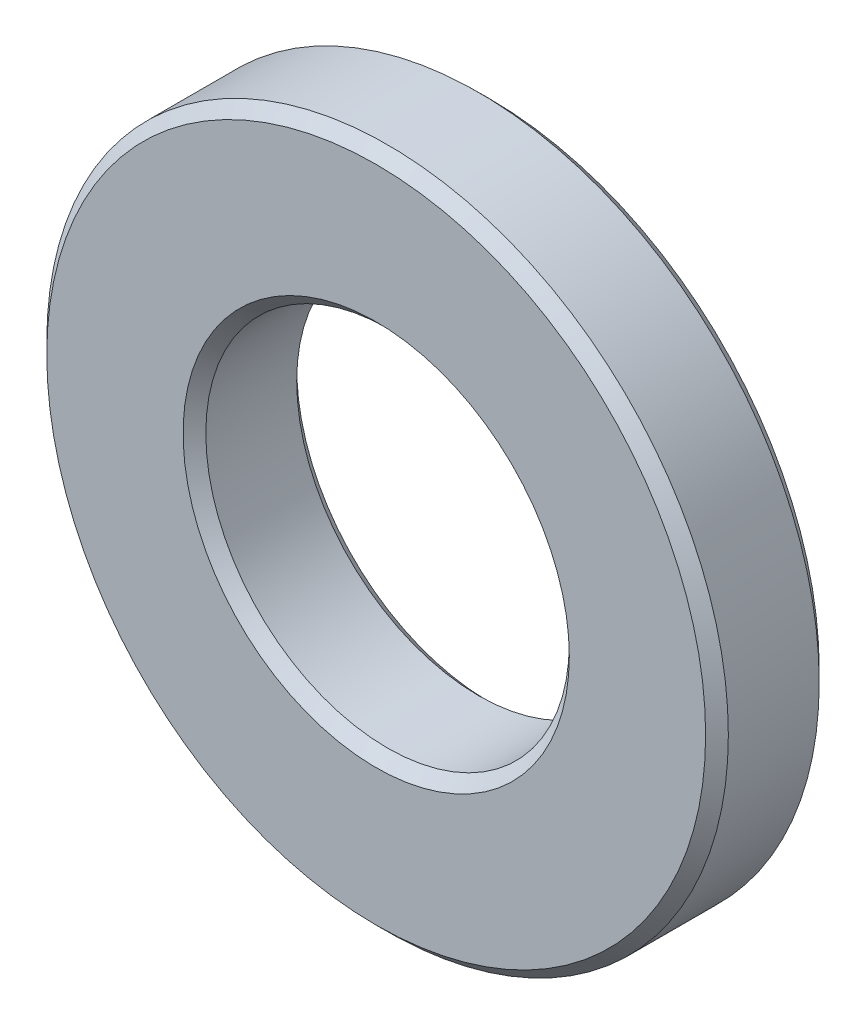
from build123d import *

# Parameters (mm, degrees)
SKETCH1_R           = 3
SKETCH1_R_2         = 1.6
BOSS_EXTRUDE2_DEPTH = 0.5
CHAMFER3_SIZE       = 0.1


with BuildPart() as part:
    # Sketch1 → Boss-Extrude2 (new, symmetric)
    with BuildSketch(Plane.XY):
        Circle(SKETCH1_R)
        Circle(SKETCH1_R_2, mode=Mode.SUBTRACT)
    extrude(amount=BOSS_EXTRUDE2_DEPTH, both=True)

    # Chamfer3
    chamfer3_edges = [part.edges().sort_by_distance(p)[0] for p in [
        (-3, 0, -0.5),
        (-3, 0, 0.5),
        (-1.6, 0, -0.5),
        (-1.6, 0, 0.5),
    ]]
    chamfer(chamfer3_edges, length=CHAMFER3_SIZE)


solid = part.part
